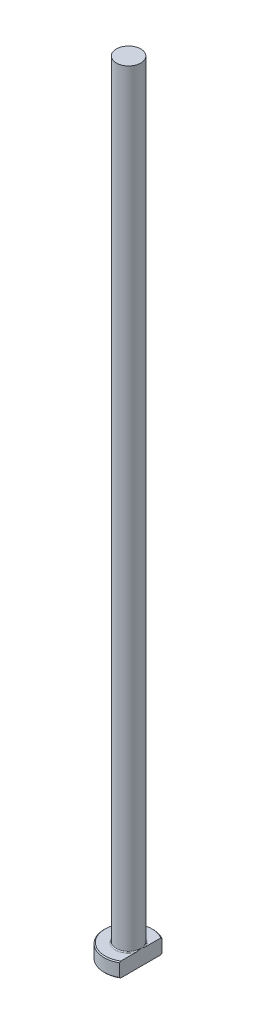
from build123d import *
from build123d.topology import SkipClean

# Parameters (mm, degrees)
CHAMFER1_SIZE = 0.2
FILLET1_R     = 0.2
KEY_DEPTH     = 161.15617378


with BuildPart() as part:
    # Sketch1 → Revolve1 (revolve)
    with BuildSketch(Plane.XY, mode=Mode.PRIVATE) as revolve1_sk:
        Polygon((0, 0), (-5, 0), (-5, 3), (-2.5, 3), (-2.5, 160), (0, 160), align=None)
    revolve(revolve1_sk.sketch.rotate(Axis((0, 259.958771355, 0), (0, -1, 0)), 270), axis=Axis((0, 259.958771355, 0), (0, -1, 0)))

    # Chamfer1
    chamfer1_edges = [part.edges().sort_by_distance(p)[0] for p in [
        (0, 3, -5),
        (0, 0, -5),
    ]]
    chamfer(chamfer1_edges, length=CHAMFER1_SIZE)

    # Fillet1
    fillet1_edges = [part.edges().sort_by_distance(p)[0] for p in [
        (0, 3, -2.5),
    ]]
    fillet(fillet1_edges, radius=FILLET1_R)

    # Sketch2 → KEY (cut, through all)
    with SkipClean():  # the faces are left unmerged after this step: merging them gives an invalid solid
        with BuildSketch(Plane(origin=(0, 0, 0), x_dir=(1, 0, 0), z_dir=(0, 1, 0))):
            with BuildLine():
                Line((2.5, 4.330127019), (2.5, -4.330127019))
                ThreePointArc((2.5, -4.330127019), (5, 0), (2.5, 4.330127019))
            make_face()
        extrude(amount=KEY_DEPTH, mode=Mode.SUBTRACT)


solid = part.part
